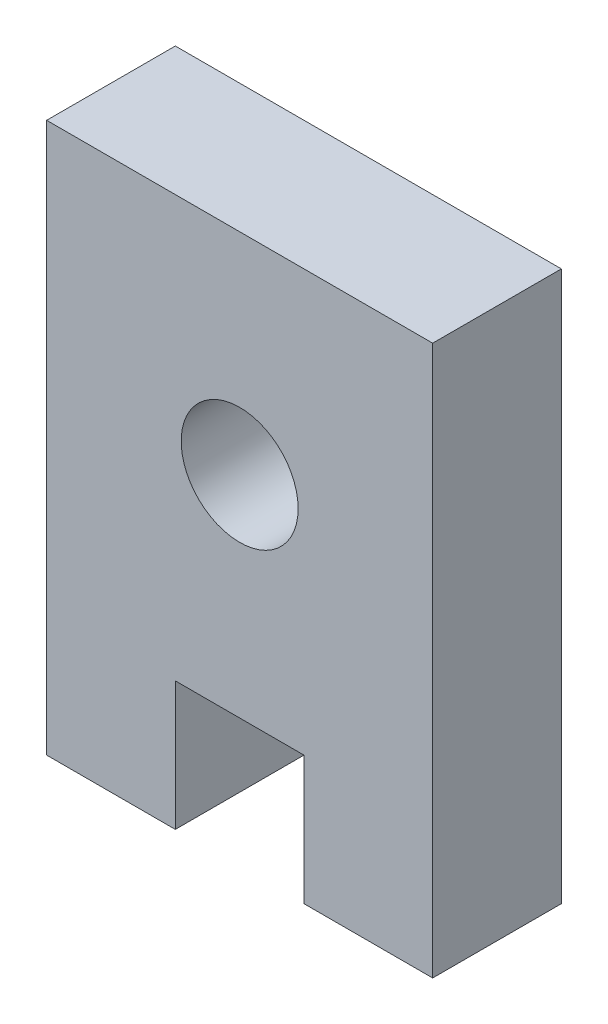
from build123d import *

# Parameters (mm, degrees)
SKETCH1_R           = 2.5
BOSS_EXTRUDE1_DEPTH = 5.5


with BuildPart() as part:
    # Sketch1 → Boss-Extrude1 (new body)
    with BuildSketch(Plane.XY):
        Polygon((-16.5, 0), (-16.5, 23.5), (0, 23.5), (0, 0), (-5.5, 0), (-5.5, 5.5), (-11, 5.5), (-11, 0), align=None)
        with Locations((-8.25, 14.5)):
            Circle(SKETCH1_R, mode=Mode.SUBTRACT)
    extrude(amount=BOSS_EXTRUDE1_DEPTH)


solid = part.part
